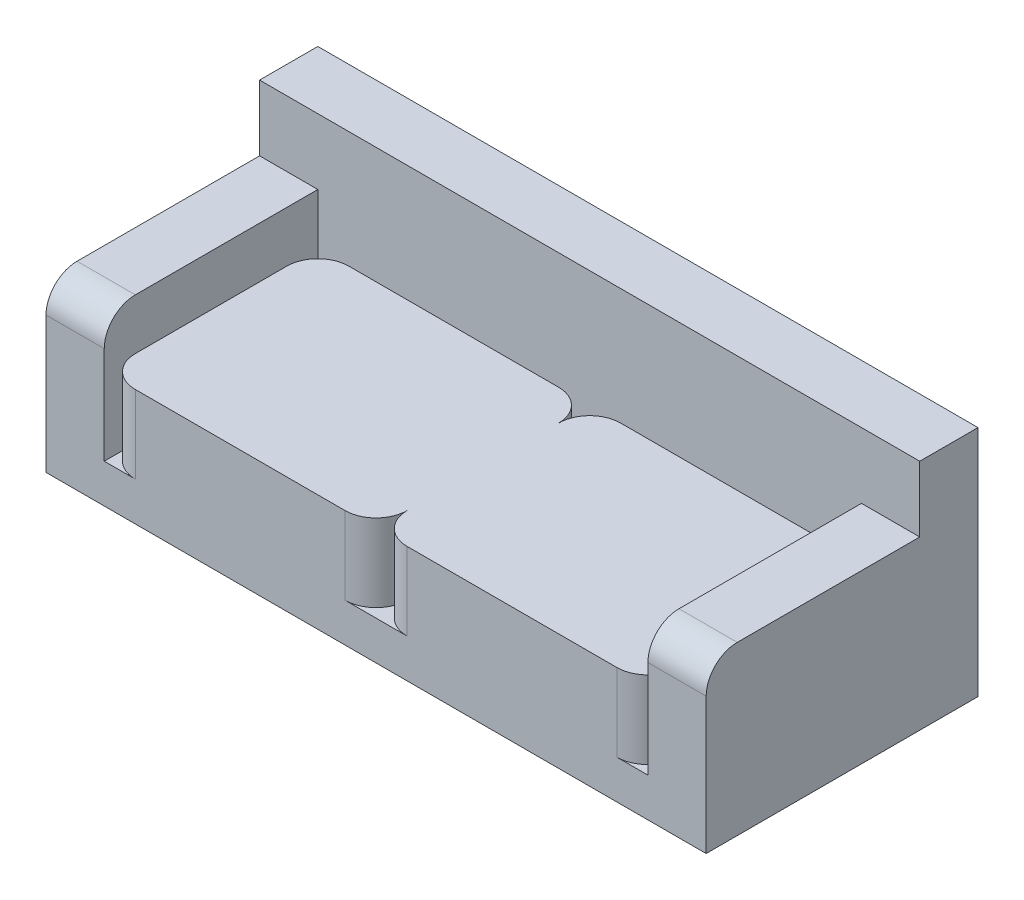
from build123d import *

# Parameters (mm, degrees)
ESQUISSE1_W                      = 700
ESQUISSE1_H                      = 550
BOSS_EXTRU_1_DEPTH               = 200
CONG_1_R                         = 80
R_P_TITION_LIN_AIRE3_COUNT       = 2
R_P_TITION_LIN_AIRE3_PITCH       = 700
CONG_1_OF_R_P_TITION_LIN_AIRE3_R = 80
ESQUISSE2_W                      = 1700
ESQUISSE2_H                      = 550
BOSS_EXTRU_2_DEPTH               = 100
ESQUISSE3_W                      = 150
ESQUISSE3_H                      = 550
BOSS_EXTRU_3_DEPTH               = 331
CONG_2_R                         = 80
ESQUISSE4_W                      = 1700
ESQUISSE4_H                      = 600
BOSS_EXTRU_4_DEPTH               = 150
ESQUISSE5_R                      = 50
BOSS_EXTRU_5_DEPTH               = 50


with BuildPart() as part:
    # Esquisse1 → Boss.-Extru.1 (new body)
    with BuildSketch(Plane(origin=(0, 0, 0), x_dir=(1, 0, 0), z_dir=(0, 1, 0))):
        Rectangle(ESQUISSE1_W, ESQUISSE1_H)
    boss_extru_1 = extrude(amount=BOSS_EXTRU_1_DEPTH)

    # Cong_1
    cong_1_edges = [part.edges().sort_by_distance(p)[0] for p in [
        (350, 100, 275),
        (-350, 100, 275),
        (-350, 100, -275),
        (350, 100, -275),
    ]]
    fillet(cong_1_edges, radius=CONG_1_R)


with BuildPart() as r_p_tition_lin_aire3_1:
    # R_p_tition lin_aire3: Boss.-Extru.1 ×2
    with Locations(*[(i * R_P_TITION_LIN_AIRE3_PITCH, 0, 0) for i in range(1, R_P_TITION_LIN_AIRE3_COUNT)]):
        add(boss_extru_1)

    # Cong_1 of R_p_tition lin_aire3
    cong_1_of_r_p_tition_lin_aire3_edges = [r_p_tition_lin_aire3_1.edges().sort_by_distance(p)[0] for p in [
        (1050, 100, 275),
        (350, 100, 275),
        (350, 100, -275),
        (1050, 100, -275),
    ]]
    fillet(cong_1_of_r_p_tition_lin_aire3_edges, radius=CONG_1_OF_R_P_TITION_LIN_AIRE3_R)


with BuildPart() as part_1:
    add(part.part)

    # R_p_tition lin_aire3 united with what th: union R_p_tition lin_aire3_1
    add(r_p_tition_lin_aire3_1.part)

    # Esquisse2 → Boss.-Extru.2 (add)
    with BuildSketch(Plane.XZ):
        with Locations((350, 0)):
            Rectangle(ESQUISSE2_W, ESQUISSE2_H)
    extrude(amount=BOSS_EXTRU_2_DEPTH)

    # Esquisse3 → Boss.-Extru.3 (add)
    with BuildSketch(Plane(origin=(0, 0, 0), x_dir=(1, 0, 0), z_dir=(0, 1, 0))):
        with Locations((1125, 0)):
            Rectangle(ESQUISSE3_W, ESQUISSE3_H)
        with Locations((-425, 0)):
            Rectangle(ESQUISSE3_W, ESQUISSE3_H)
    extrude(amount=BOSS_EXTRU_3_DEPTH)

    # Cong_2
    cong_2_edges = [part_1.edges().sort_by_distance(p)[0] for p in [
        (1125, 331, 275),
        (-425, 331, 275),
    ]]
    fillet(cong_2_edges, radius=CONG_2_R)

    # Esquisse4 → Boss.-Extru.4 (add)
    with BuildSketch(Plane(origin=(0, 0, -275), x_dir=(-1, 0, 0), z_dir=(0, 0, -1))):
        with Locations((-350, 200)):
            Rectangle(ESQUISSE4_W, ESQUISSE4_H)
    extrude(amount=BOSS_EXTRU_4_DEPTH)

    # Esquisse5 → Boss.-Extru.5 (add)
    with BuildSketch(Plane.XZ.offset(100)):
        with Locations(Location((-400, 175, 0), (0, 0, 90))):
            Circle(ESQUISSE5_R)
        with Locations(Location((1100, 175, 0), (0, 0, 90))):
            Circle(ESQUISSE5_R)
        with Locations(Location((1100, -325, 0), (0, 0, 90))):
            Circle(ESQUISSE5_R)
        with Locations(Location((-400, -325, 0), (0, 0, 90))):
            Circle(ESQUISSE5_R)
    extrude(amount=BOSS_EXTRU_5_DEPTH)


solid = part_1.part
